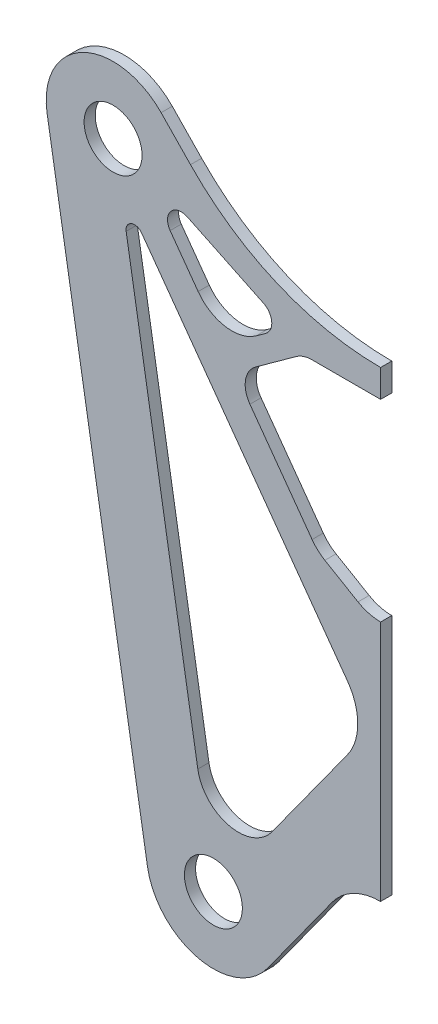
from build123d import *

# Parameters (mm, degrees)
SKIZZE1_R                       = 13
AUFSATZ_LINEAR_AUSTRAGEN1_DEPTH = 5


with BuildPart() as part:
    # Skizze1 → Aufsatz-Linear austragen1 (new body)
    with BuildSketch(Plane.XY):
        with BuildLine():
            Line((-218.509284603, 29.350255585), (-173.509284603, -240.649744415))
            ThreePointArc((-173.509284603, -240.649744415), (-150.761705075, -264.926615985), (-119.597090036, -253.282491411))
            Line((-119.597090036, -253.282491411), (-90.582860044, -213.108942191))
            ThreePointArc((-90.582860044, -213.108942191), (-81.084081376, -204.961244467), (-68.917466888, -202.031181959))
            Line((-68.917466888, -202.031181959), (-68.917466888, -93.470658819))
            ThreePointArc((-68.917466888, -93.470658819), (-74.167780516, -92.77060769), (-79.051250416, -90.719367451))
            Line((-79.051250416, -90.719367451), (-93.917466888, -82.004742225))
            ThreePointArc((-93.917466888, -82.004742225), (-97.055279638, -79.697696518), (-99.650356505, -76.793577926))
            Line((-99.650356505, -76.793577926), (-127.534912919, -38.184192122))
            ThreePointArc((-127.534912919, -38.184192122), (-129.5238242, -29.795134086), (-124.99823703, -22.456801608))
            Line((-124.99823703, -22.456801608), (-106.712824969, -9.250670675))
            ThreePointArc((-106.712824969, -9.250670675), (-103.417007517, -7.580180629), (-99.767100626, -7.004742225))
            Line((-99.767100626, -7.004742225), (-93.917466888, -7.004742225))
            Line((-93.917466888, -7.004742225), (-68.917466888, -7.004742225))
            Line((-68.917466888, -7.004742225), (-68.917466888, 5.393411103))
            ThreePointArc((-68.917466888, 5.393411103), (-115.224034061, 14.801644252), (-154.187722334, 41.534470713))
            Line((-154.187722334, 41.534470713), (-167.359662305, 55.145136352))
            ThreePointArc((-167.359662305, 55.145136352), (-202.425994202, 61.06878321), (-218.509284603, 29.350255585))
        make_face()
        with Locations((-188.917466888, 34.282225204)):
            Circle(SKIZZE1_R, mode=Mode.SUBTRACT)
        with Locations((-143.917466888, -235.717774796)):
            Circle(SKIZZE1_R, mode=Mode.SUBTRACT)
        with BuildLine():
            Line((-155.644158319, 20.549603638), (-121.443837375, 4.09942834))
            ThreePointArc((-121.443837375, 4.09942834), (-117.750102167, -1.236210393), (-120.445717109, -7.139292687))
            Line((-120.445717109, -7.139292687), (-124.720304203, -10.226494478))
            ThreePointArc((-124.720304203, -10.226494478), (-138.609918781, -13.519499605), (-150.759865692, -6.026565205))
            Line((-150.759865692, -6.026565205), (-163.325074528, 11.37141626))
            ThreePointArc((-163.325074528, 11.37141626), (-163.05471594, 18.948206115), (-155.644158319, 20.549603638))
        make_face(mode=Mode.SUBTRACT)
        with BuildLine():
            Line((-83.800631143, -123.788973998), (-176.164477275, 4.09942834))
            ThreePointArc((-176.164477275, 4.09942834), (-180.744629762, 5.391698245), (-183.047741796, 1.22715346))
            Line((-183.047741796, 1.22715346), (-150.912666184, -191.583300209))
            ThreePointArc((-150.912666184, -191.583300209), (-136.885716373, -206.553264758), (-117.668529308, -199.373091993))
            Line((-117.668529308, -199.373091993), (-83.800631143, -152.479079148))
            ThreePointArc((-83.800631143, -152.479079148), (-79.162099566, -138.134026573), (-83.800631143, -123.788973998))
        make_face(mode=Mode.SUBTRACT)
    extrude(amount=AUFSATZ_LINEAR_AUSTRAGEN1_DEPTH)


solid = part.part
